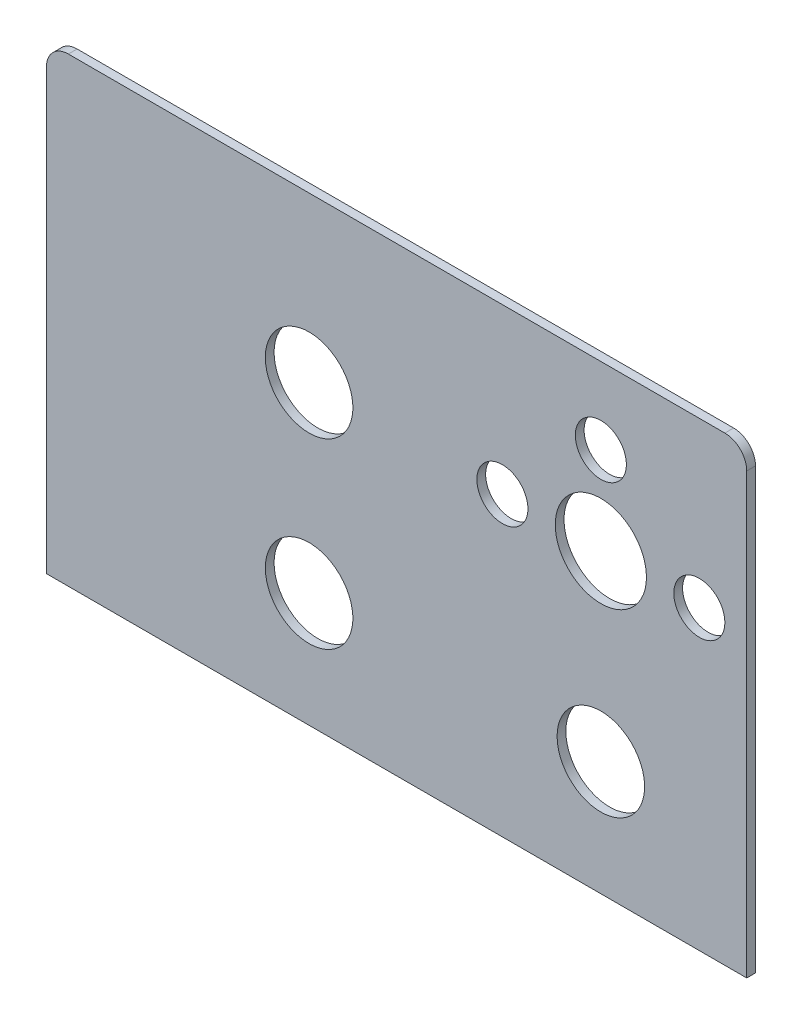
ISO-10303-21;
HEADER;
FILE_DESCRIPTION(('STEP AP214'),'2;1');
FILE_NAME('part.step','',(''),(''),'','','');
FILE_SCHEMA(('AUTOMOTIVE_DESIGN { 1 0 10303 214 1 1 1 1 }'));
ENDSEC;
DATA;
#1=APPLICATION_CONTEXT('core data for automotive mechanical design processes');
#2=APPLICATION_PROTOCOL_DEFINITION('international standard','automotive_design',2000,#1);
#3=PRODUCT_CONTEXT('',#1,'mechanical');
#4=PRODUCT('Part','Part','',(#3));
#5=PRODUCT_RELATED_PRODUCT_CATEGORY('part','',(#4));
#6=PRODUCT_DEFINITION_FORMATION('','',#4);
#7=PRODUCT_DEFINITION_CONTEXT('part definition',#1,'design');
#8=PRODUCT_DEFINITION('design','',#6,#7);
#9=PRODUCT_DEFINITION_SHAPE('','',#8);
#10=(LENGTH_UNIT() NAMED_UNIT(*) SI_UNIT(.MILLI.,.METRE.));
#11=(NAMED_UNIT(*) PLANE_ANGLE_UNIT() SI_UNIT($,.RADIAN.));
#12=(NAMED_UNIT(*) SI_UNIT($,.STERADIAN.) SOLID_ANGLE_UNIT());
#13=UNCERTAINTY_MEASURE_WITH_UNIT(LENGTH_MEASURE(1.E-05),#10,'distance_accuracy_value','');
#14=(GEOMETRIC_REPRESENTATION_CONTEXT(3) GLOBAL_UNCERTAINTY_ASSIGNED_CONTEXT((#13)) GLOBAL_UNIT_ASSIGNED_CONTEXT((#10,
#11,#12)) REPRESENTATION_CONTEXT('',''));
#15=CARTESIAN_POINT('',(0.,0.,0.));
#16=DIRECTION('',(0.,0.,1.));
#17=DIRECTION('',(1.,0.,0.));
#18=AXIS2_PLACEMENT_3D('',#15,#16,#17);
#19=CARTESIAN_POINT('',(0.,0.,-1.19999999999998));
#20=DIRECTION('',(1.,0.,0.));
#21=DIRECTION('',(0.,0.,-0.999999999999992));
#22=AXIS2_PLACEMENT_3D('',#19,#20,#21);
#23=PLANE('',#22);
#24=DIRECTION('',(0.,0.,0.999999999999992));
#25=VECTOR('',#24,1.);
#26=CARTESIAN_POINT('',(0.,1.80000000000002,-1.19999999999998));
#27=LINE('',#26,#25);
#28=CARTESIAN_POINT('',(0.,1.80000000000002,-1.19999999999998));
#29=VERTEX_POINT('',#28);
#30=CARTESIAN_POINT('',(0.,1.80000000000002,0.));
#31=VERTEX_POINT('',#30);
#32=EDGE_CURVE('E127',#29,#31,#27,.T.);
#33=ORIENTED_EDGE('',*,*,#32,.F.);
#34=DIRECTION('',(0.,1.00000000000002,0.));
#35=VECTOR('',#34,1.);
#36=CARTESIAN_POINT('',(0.,0.,-1.19999999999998));
#37=LINE('',#36,#35);
#38=CARTESIAN_POINT('',(2.91433543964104E-13,62.0000000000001,-1.20000000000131));
#39=VERTEX_POINT('',#38);
#40=EDGE_CURVE('E121',#29,#39,#37,.T.);
#41=ORIENTED_EDGE('',*,*,#40,.T.);
#42=DIRECTION('',(0.,0.,0.999999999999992));
#43=VECTOR('',#42,1.);
#44=CARTESIAN_POINT('',(2.91433543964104E-13,62.0000000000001,-1.20000000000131));
#45=LINE('',#44,#43);
#46=CARTESIAN_POINT('',(2.08166817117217E-13,62.0000000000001,-1.33226762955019E-12));
#47=VERTEX_POINT('',#46);
#48=EDGE_CURVE('E11',#39,#47,#45,.T.);
#49=ORIENTED_EDGE('',*,*,#48,.T.);
#50=DIRECTION('',(0.,1.00000000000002,0.));
#51=VECTOR('',#50,1.);
#52=CARTESIAN_POINT('',(0.,0.,0.));
#53=LINE('',#52,#51);
#54=EDGE_CURVE('E162',#31,#47,#53,.T.);
#55=ORIENTED_EDGE('',*,*,#54,.F.);
#56=EDGE_LOOP('',(#33,#41,#49,#55));
#57=FACE_BOUND('',#56,.T.);
#58=ADVANCED_FACE('F44',(#57),#23,.T.);
#59=CARTESIAN_POINT('',(0.,0.,-1.19999999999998));
#60=DIRECTION('',(0.,0.,0.999999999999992));
#61=DIRECTION('',(1.,0.,0.));
#62=AXIS2_PLACEMENT_3D('',#59,#60,#61);
#63=PLANE('',#62);
#64=CARTESIAN_POINT('',(-19.9999999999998,17.4999999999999,-1.19999999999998));
#65=DIRECTION('',(0.,0.,-0.999999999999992));
#66=DIRECTION('',(-1.,0.,0.));
#67=AXIS2_PLACEMENT_3D('',#64,#65,#66);
#68=CIRCLE('',#67,6.);
#69=CARTESIAN_POINT('',(-26.,17.4999999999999,-1.19999999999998));
#70=VERTEX_POINT('',#69);
#71=EDGE_CURVE('E204',#70,#70,#68,.T.);
#72=ORIENTED_EDGE('',*,*,#71,.F.);
#73=EDGE_LOOP('',(#72));
#74=FACE_BOUND('',#73,.T.);
#75=CARTESIAN_POINT('',(-60.,17.4999999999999,-1.19999999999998));
#76=DIRECTION('',(0.,0.,-0.999999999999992));
#77=DIRECTION('',(-1.,0.,0.));
#78=AXIS2_PLACEMENT_3D('',#75,#76,#77);
#79=CIRCLE('',#78,6.);
#80=CARTESIAN_POINT('',(-66.,17.4999999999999,-1.19999999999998));
#81=VERTEX_POINT('',#80);
#82=EDGE_CURVE('E433',#81,#81,#79,.T.);
#83=ORIENTED_EDGE('',*,*,#82,.F.);
#84=EDGE_LOOP('',(#83));
#85=FACE_BOUND('',#84,.T.);
#86=CARTESIAN_POINT('',(-60.,42.5,-1.20000000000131));
#87=DIRECTION('',(0.,0.,-0.999999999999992));
#88=DIRECTION('',(-1.,0.,0.));
#89=AXIS2_PLACEMENT_3D('',#86,#87,#88);
#90=CIRCLE('',#89,6.);
#91=CARTESIAN_POINT('',(-66.,42.4999999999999,-1.20000000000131));
#92=VERTEX_POINT('',#91);
#93=EDGE_CURVE('E436',#92,#92,#90,.T.);
#94=ORIENTED_EDGE('',*,*,#93,.F.);
#95=EDGE_LOOP('',(#94));
#96=FACE_BOUND('',#95,.T.);
#97=CARTESIAN_POINT('',(-19.9999999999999,42.5,-1.20000000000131));
#98=DIRECTION('',(0.,0.,0.999999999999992));
#99=DIRECTION('',(1.,0.,0.));
#100=AXIS2_PLACEMENT_3D('',#97,#98,#99);
#101=CIRCLE('',#100,6.25);
#102=CARTESIAN_POINT('',(-13.7499999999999,42.5,-1.20000000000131));
#103=VERTEX_POINT('',#102);
#104=EDGE_CURVE('E134',#103,#103,#101,.T.);
#105=ORIENTED_EDGE('',*,*,#104,.T.);
#106=EDGE_LOOP('',(#105));
#107=FACE_BOUND('',#106,.T.);
#108=CARTESIAN_POINT('',(-33.4999999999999,42.5,-1.20000000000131));
#109=DIRECTION('',(0.,0.,0.999999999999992));
#110=DIRECTION('',(1.,0.,0.));
#111=AXIS2_PLACEMENT_3D('',#108,#109,#110);
#112=CIRCLE('',#111,3.5);
#113=CARTESIAN_POINT('',(-29.9999999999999,42.5,-1.20000000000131));
#114=VERTEX_POINT('',#113);
#115=EDGE_CURVE('E158',#114,#114,#112,.T.);
#116=ORIENTED_EDGE('',*,*,#115,.T.);
#117=EDGE_LOOP('',(#116));
#118=FACE_BOUND('',#117,.T.);
#119=CARTESIAN_POINT('',(-6.49999999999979,42.5,-1.19999999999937));
#120=DIRECTION('',(0.,0.,0.999999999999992));
#121=DIRECTION('',(1.,0.,0.));
#122=AXIS2_PLACEMENT_3D('',#119,#120,#121);
#123=CIRCLE('',#122,3.50000000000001);
#124=CARTESIAN_POINT('',(-2.99999999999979,42.5,-1.19999999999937));
#125=VERTEX_POINT('',#124);
#126=EDGE_CURVE('E150',#125,#125,#123,.T.);
#127=ORIENTED_EDGE('',*,*,#126,.T.);
#128=EDGE_LOOP('',(#127));
#129=FACE_BOUND('',#128,.T.);
#130=CARTESIAN_POINT('',(-20.,54.5,-1.19999999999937));
#131=DIRECTION('',(0.,0.,0.999999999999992));
#132=DIRECTION('',(1.,0.,0.));
#133=AXIS2_PLACEMENT_3D('',#130,#131,#132);
#134=CIRCLE('',#133,3.5);
#135=CARTESIAN_POINT('',(-16.5,54.5,-1.19999999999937));
#136=VERTEX_POINT('',#135);
#137=EDGE_CURVE('E142',#136,#136,#134,.T.);
#138=ORIENTED_EDGE('',*,*,#137,.T.);
#139=EDGE_LOOP('',(#138));
#140=FACE_BOUND('',#139,.T.);
#141=ORIENTED_EDGE('',*,*,#40,.F.);
#142=DIRECTION('',(1.,0.,0.));
#143=VECTOR('',#142,1.);
#144=CARTESIAN_POINT('',(14.7999999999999,1.80000000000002,-1.19999999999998));
#145=LINE('',#144,#143);
#146=CARTESIAN_POINT('',(-96.,1.79999999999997,-1.19999999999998));
#147=VERTEX_POINT('',#146);
#148=EDGE_CURVE('E105',#147,#29,#145,.T.);
#149=ORIENTED_EDGE('',*,*,#148,.F.);
#150=DIRECTION('',(0.,-1.00000000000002,0.));
#151=VECTOR('',#150,1.);
#152=CARTESIAN_POINT('',(-96.,0.,-1.19999999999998));
#153=LINE('',#152,#151);
#154=CARTESIAN_POINT('',(-95.9999999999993,61.9999999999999,-1.19999999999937));
#155=VERTEX_POINT('',#154);
#156=EDGE_CURVE('E110',#155,#147,#153,.T.);
#157=ORIENTED_EDGE('',*,*,#156,.F.);
#158=CARTESIAN_POINT('',(-92.9999999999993,61.9999999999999,-1.20000000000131));
#159=DIRECTION('',(0.,0.,0.999999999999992));
#160=DIRECTION('',(1.,0.,0.));
#161=AXIS2_PLACEMENT_3D('',#158,#159,#160);
#162=CIRCLE('',#161,3.);
#163=CARTESIAN_POINT('',(-92.9999999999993,64.9999999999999,-1.20000000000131));
#164=VERTEX_POINT('',#163);
#165=EDGE_CURVE('E54',#155,#164,#162,.F.);
#166=ORIENTED_EDGE('',*,*,#165,.T.);
#167=DIRECTION('',(-1.,0.,0.));
#168=VECTOR('',#167,1.);
#169=CARTESIAN_POINT('',(2.4980018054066E-13,65.,-1.20000000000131));
#170=LINE('',#169,#168);
#171=CARTESIAN_POINT('',(-2.99999999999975,65.,-1.20000000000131));
#172=VERTEX_POINT('',#171);
#173=EDGE_CURVE('E117',#172,#164,#170,.T.);
#174=ORIENTED_EDGE('',*,*,#173,.F.);
#175=CARTESIAN_POINT('',(-2.99999999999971,62.0000000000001,-1.20000000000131));
#176=DIRECTION('',(0.,0.,0.999999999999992));
#177=DIRECTION('',(1.,0.,0.));
#178=AXIS2_PLACEMENT_3D('',#175,#176,#177);
#179=CIRCLE('',#178,3.);
#180=EDGE_CURVE('E70',#172,#39,#179,.F.);
#181=ORIENTED_EDGE('',*,*,#180,.T.);
#182=EDGE_LOOP('',(#141,#149,#157,#166,#174,#181));
#183=FACE_BOUND('',#182,.T.);
#184=ADVANCED_FACE('F119',(#74,#85,#96,#107,#118,#129,#140,#183),#63,.F.);
#185=CARTESIAN_POINT('',(0.,0.,0.));
#186=DIRECTION('',(0.,0.,0.999999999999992));
#187=DIRECTION('',(1.,0.,0.));
#188=AXIS2_PLACEMENT_3D('',#185,#186,#187);
#189=PLANE('',#188);
#190=CARTESIAN_POINT('',(-19.9999999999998,17.4999999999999,0.));
#191=DIRECTION('',(0.,0.,0.999999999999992));
#192=DIRECTION('',(1.,0.,0.));
#193=AXIS2_PLACEMENT_3D('',#190,#191,#192);
#194=CIRCLE('',#193,6.);
#195=CARTESIAN_POINT('',(-26.,17.4999999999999,0.));
#196=VERTEX_POINT('',#195);
#197=EDGE_CURVE('E48',#196,#196,#194,.T.);
#198=ORIENTED_EDGE('',*,*,#197,.F.);
#199=EDGE_LOOP('',(#198));
#200=FACE_BOUND('',#199,.T.);
#201=CARTESIAN_POINT('',(-60.0000000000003,17.4999999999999,0.));
#202=DIRECTION('',(0.,0.,0.999999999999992));
#203=DIRECTION('',(1.,0.,0.));
#204=AXIS2_PLACEMENT_3D('',#201,#202,#203);
#205=CIRCLE('',#204,6.);
#206=CARTESIAN_POINT('',(-66.,17.4999999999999,0.));
#207=VERTEX_POINT('',#206);
#208=EDGE_CURVE('E203',#207,#207,#205,.T.);
#209=ORIENTED_EDGE('',*,*,#208,.F.);
#210=EDGE_LOOP('',(#209));
#211=FACE_BOUND('',#210,.T.);
#212=CARTESIAN_POINT('',(-59.9999999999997,42.5,-1.33226762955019E-12));
#213=DIRECTION('',(0.,0.,0.999999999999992));
#214=DIRECTION('',(1.,0.,0.));
#215=AXIS2_PLACEMENT_3D('',#212,#213,#214);
#216=CIRCLE('',#215,6.);
#217=CARTESIAN_POINT('',(-66.,42.4999999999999,-1.33573707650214E-12));
#218=VERTEX_POINT('',#217);
#219=EDGE_CURVE('E200',#218,#218,#216,.T.);
#220=ORIENTED_EDGE('',*,*,#219,.F.);
#221=EDGE_LOOP('',(#220));
#222=FACE_BOUND('',#221,.T.);
#223=DIRECTION('',(-1.,0.,0.));
#224=VECTOR('',#223,1.);
#225=CARTESIAN_POINT('',(0.,1.80000000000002,0.));
#226=LINE('',#225,#224);
#227=CARTESIAN_POINT('',(-96.,1.79999999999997,0.));
#228=VERTEX_POINT('',#227);
#229=EDGE_CURVE('E106',#31,#228,#226,.T.);
#230=ORIENTED_EDGE('',*,*,#229,.F.);
#231=ORIENTED_EDGE('',*,*,#54,.T.);
#232=CARTESIAN_POINT('',(-2.99999999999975,62.0000000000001,-1.33226762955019E-12));
#233=DIRECTION('',(0.,0.,0.999999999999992));
#234=DIRECTION('',(1.,0.,0.));
#235=AXIS2_PLACEMENT_3D('',#232,#233,#234);
#236=CIRCLE('',#235,3.);
#237=CARTESIAN_POINT('',(-2.99999999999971,65.,-1.33226762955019E-12));
#238=VERTEX_POINT('',#237);
#239=EDGE_CURVE('E186',#47,#238,#236,.T.);
#240=ORIENTED_EDGE('',*,*,#239,.T.);
#241=DIRECTION('',(-1.,0.,0.));
#242=VECTOR('',#241,1.);
#243=CARTESIAN_POINT('',(2.91433543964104E-13,65.,-1.33226762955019E-12));
#244=LINE('',#243,#242);
#245=CARTESIAN_POINT('',(-92.9999999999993,64.9999999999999,-1.33226762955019E-12));
#246=VERTEX_POINT('',#245);
#247=EDGE_CURVE('E175',#238,#246,#244,.T.);
#248=ORIENTED_EDGE('',*,*,#247,.T.);
#249=CARTESIAN_POINT('',(-92.9999999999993,61.9999999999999,-1.33226762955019E-12));
#250=DIRECTION('',(0.,0.,0.999999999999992));
#251=DIRECTION('',(1.,0.,0.));
#252=AXIS2_PLACEMENT_3D('',#249,#250,#251);
#253=CIRCLE('',#252,3.);
#254=CARTESIAN_POINT('',(-95.9999999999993,61.9999999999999,6.66133814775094E-13));
#255=VERTEX_POINT('',#254);
#256=EDGE_CURVE('E190',#246,#255,#253,.T.);
#257=ORIENTED_EDGE('',*,*,#256,.T.);
#258=DIRECTION('',(0.,-1.00000000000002,0.));
#259=VECTOR('',#258,1.);
#260=CARTESIAN_POINT('',(-96.,0.,0.));
#261=LINE('',#260,#259);
#262=EDGE_CURVE('E168',#255,#228,#261,.T.);
#263=ORIENTED_EDGE('',*,*,#262,.T.);
#264=EDGE_LOOP('',(#230,#231,#240,#248,#257,#263));
#265=FACE_BOUND('',#264,.T.);
#266=CARTESIAN_POINT('',(-19.9999999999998,42.5,-1.33226762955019E-12));
#267=DIRECTION('',(0.,0.,0.999999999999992));
#268=DIRECTION('',(1.,0.,0.));
#269=AXIS2_PLACEMENT_3D('',#266,#267,#268);
#270=CIRCLE('',#269,6.25);
#271=CARTESIAN_POINT('',(-13.7499999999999,42.5,-1.32988238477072E-12));
#272=VERTEX_POINT('',#271);
#273=EDGE_CURVE('E133',#272,#272,#270,.T.);
#274=ORIENTED_EDGE('',*,*,#273,.F.);
#275=EDGE_LOOP('',(#274));
#276=FACE_BOUND('',#275,.T.);
#277=CARTESIAN_POINT('',(-19.9999999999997,54.5,6.66133814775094E-13));
#278=DIRECTION('',(0.,0.,0.999999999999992));
#279=DIRECTION('',(1.,0.,0.));
#280=AXIS2_PLACEMENT_3D('',#277,#278,#279);
#281=CIRCLE('',#280,3.5);
#282=CARTESIAN_POINT('',(-16.5,54.5,6.67434857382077E-13));
#283=VERTEX_POINT('',#282);
#284=EDGE_CURVE('E138',#283,#283,#281,.T.);
#285=ORIENTED_EDGE('',*,*,#284,.F.);
#286=EDGE_LOOP('',(#285));
#287=FACE_BOUND('',#286,.T.);
#288=CARTESIAN_POINT('',(-6.49999999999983,42.5,6.66133814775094E-13));
#289=DIRECTION('',(0.,0.,0.999999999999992));
#290=DIRECTION('',(1.,0.,0.));
#291=AXIS2_PLACEMENT_3D('',#288,#289,#290);
#292=CIRCLE('',#291,3.50000000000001);
#293=CARTESIAN_POINT('',(-2.99999999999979,42.5,6.67434857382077E-13));
#294=VERTEX_POINT('',#293);
#295=EDGE_CURVE('E146',#294,#294,#292,.T.);
#296=ORIENTED_EDGE('',*,*,#295,.F.);
#297=EDGE_LOOP('',(#296));
#298=FACE_BOUND('',#297,.T.);
#299=CARTESIAN_POINT('',(-33.4999999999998,42.5,-1.33226762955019E-12));
#300=DIRECTION('',(0.,0.,0.999999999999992));
#301=DIRECTION('',(1.,0.,0.));
#302=AXIS2_PLACEMENT_3D('',#299,#300,#301);
#303=CIRCLE('',#302,3.5);
#304=CARTESIAN_POINT('',(-29.9999999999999,42.5,-1.33096658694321E-12));
#305=VERTEX_POINT('',#304);
#306=EDGE_CURVE('E154',#305,#305,#303,.T.);
#307=ORIENTED_EDGE('',*,*,#306,.F.);
#308=EDGE_LOOP('',(#307));
#309=FACE_BOUND('',#308,.T.);
#310=ADVANCED_FACE('F218',(#200,#211,#222,#265,#276,#287,#298,#309),#189,.T.);
#311=CARTESIAN_POINT('',(-96.,0.,-1.19999999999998));
#312=DIRECTION('',(-1.,0.,0.));
#313=DIRECTION('',(0.,0.,0.999999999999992));
#314=AXIS2_PLACEMENT_3D('',#311,#312,#313);
#315=PLANE('',#314);
#316=DIRECTION('',(0.,0.,-0.999999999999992));
#317=VECTOR('',#316,1.);
#318=CARTESIAN_POINT('',(-96.0000000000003,1.79999999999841,70.6));
#319=LINE('',#318,#317);
#320=EDGE_CURVE('E62',#228,#147,#319,.T.);
#321=ORIENTED_EDGE('',*,*,#320,.F.);
#322=ORIENTED_EDGE('',*,*,#262,.F.);
#323=DIRECTION('',(0.,0.,0.999999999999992));
#324=VECTOR('',#323,1.);
#325=CARTESIAN_POINT('',(-95.9999999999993,61.9999999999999,-1.19999999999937));
#326=LINE('',#325,#324);
#327=EDGE_CURVE('E112',#255,#155,#326,.F.);
#328=ORIENTED_EDGE('',*,*,#327,.T.);
#329=ORIENTED_EDGE('',*,*,#156,.T.);
#330=EDGE_LOOP('',(#321,#322,#328,#329));
#331=FACE_BOUND('',#330,.T.);
#332=ADVANCED_FACE('F111',(#331),#315,.T.);
#333=CARTESIAN_POINT('',(2.4980018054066E-13,65.,-1.20000000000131));
#334=DIRECTION('',(0.,1.00000000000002,0.));
#335=DIRECTION('',(-1.,0.,0.));
#336=AXIS2_PLACEMENT_3D('',#333,#334,#335);
#337=PLANE('',#336);
#338=ORIENTED_EDGE('',*,*,#173,.T.);
#339=DIRECTION('',(0.,0.,0.999999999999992));
#340=VECTOR('',#339,1.);
#341=CARTESIAN_POINT('',(-92.9999999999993,64.9999999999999,-1.20000000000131));
#342=LINE('',#341,#340);
#343=EDGE_CURVE('E183',#164,#246,#342,.T.);
#344=ORIENTED_EDGE('',*,*,#343,.T.);
#345=ORIENTED_EDGE('',*,*,#247,.F.);
#346=DIRECTION('',(0.,0.,0.999999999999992));
#347=VECTOR('',#346,1.);
#348=CARTESIAN_POINT('',(-2.99999999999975,65.,-1.20000000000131));
#349=LINE('',#348,#347);
#350=EDGE_CURVE('E116',#238,#172,#349,.F.);
#351=ORIENTED_EDGE('',*,*,#350,.T.);
#352=EDGE_LOOP('',(#338,#344,#345,#351));
#353=FACE_BOUND('',#352,.T.);
#354=ADVANCED_FACE('F238',(#353),#337,.T.);
#355=CARTESIAN_POINT('',(-33.4999999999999,42.5,-1.20000000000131));
#356=DIRECTION('',(0.,0.,0.999999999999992));
#357=DIRECTION('',(1.,0.,0.));
#358=AXIS2_PLACEMENT_3D('',#355,#356,#357);
#359=CYLINDRICAL_SURFACE('',#358,3.5);
#360=CARTESIAN_POINT('',(-29.9999999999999,42.5,-1.20000000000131));
#361=CARTESIAN_POINT('',(-29.9999999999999,42.5,-1.18750000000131));
#362=CARTESIAN_POINT('',(-29.9999999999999,42.5,-1.17500000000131));
#363=CARTESIAN_POINT('',(-29.9999999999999,42.5,-1.15000000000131));
#364=CARTESIAN_POINT('',(-29.9999999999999,42.5,-1.13750000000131));
#365=CARTESIAN_POINT('',(-29.9999999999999,42.5,-1.11250000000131));
#366=CARTESIAN_POINT('',(-29.9999999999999,42.5,-1.10000000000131));
#367=CARTESIAN_POINT('',(-29.9999999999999,42.5,-1.07500000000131));
#368=CARTESIAN_POINT('',(-29.9999999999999,42.5,-1.06250000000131));
#369=CARTESIAN_POINT('',(-29.9999999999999,42.5,-1.03750000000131));
#370=CARTESIAN_POINT('',(-29.9999999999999,42.5,-1.02500000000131));
#371=CARTESIAN_POINT('',(-29.9999999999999,42.5,-1.00000000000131));
#372=CARTESIAN_POINT('',(-29.9999999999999,42.5,-0.987500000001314));
#373=CARTESIAN_POINT('',(-29.9999999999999,42.5,-0.962500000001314));
#374=CARTESIAN_POINT('',(-29.9999999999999,42.5,-0.950000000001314));
#375=CARTESIAN_POINT('',(-29.9999999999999,42.5,-0.925000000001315));
#376=CARTESIAN_POINT('',(-29.9999999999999,42.5,-0.912500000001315));
#377=CARTESIAN_POINT('',(-29.9999999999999,42.5,-0.887500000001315));
#378=CARTESIAN_POINT('',(-29.9999999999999,42.5,-0.875000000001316));
#379=CARTESIAN_POINT('',(-29.9999999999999,42.5,-0.850000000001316));
#380=CARTESIAN_POINT('',(-29.9999999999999,42.5,-0.837500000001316));
#381=CARTESIAN_POINT('',(-29.9999999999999,42.5,-0.812500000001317));
#382=CARTESIAN_POINT('',(-29.9999999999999,42.5,-0.800000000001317));
#383=CARTESIAN_POINT('',(-29.9999999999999,42.5,-0.775000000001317));
#384=CARTESIAN_POINT('',(-29.9999999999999,42.5,-0.762500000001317));
#385=CARTESIAN_POINT('',(-29.9999999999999,42.5,-0.737500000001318));
#386=CARTESIAN_POINT('',(-29.9999999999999,42.5,-0.725000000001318));
#387=CARTESIAN_POINT('',(-29.9999999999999,42.5,-0.700000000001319));
#388=CARTESIAN_POINT('',(-29.9999999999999,42.5,-0.687500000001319));
#389=CARTESIAN_POINT('',(-29.9999999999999,42.5,-0.662500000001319));
#390=CARTESIAN_POINT('',(-29.9999999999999,42.5,-0.650000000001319));
#391=CARTESIAN_POINT('',(-29.9999999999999,42.5,-0.62500000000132));
#392=CARTESIAN_POINT('',(-29.9999999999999,42.5,-0.61250000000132));
#393=CARTESIAN_POINT('',(-29.9999999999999,42.5,-0.587500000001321));
#394=CARTESIAN_POINT('',(-29.9999999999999,42.5,-0.575000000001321));
#395=CARTESIAN_POINT('',(-29.9999999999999,42.5,-0.550000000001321));
#396=CARTESIAN_POINT('',(-29.9999999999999,42.5,-0.537500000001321));
#397=CARTESIAN_POINT('',(-29.9999999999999,42.5,-0.512500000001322));
#398=CARTESIAN_POINT('',(-29.9999999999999,42.5,-0.500000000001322));
#399=CARTESIAN_POINT('',(-29.9999999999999,42.5,-0.475000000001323));
#400=CARTESIAN_POINT('',(-29.9999999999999,42.5,-0.462500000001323));
#401=CARTESIAN_POINT('',(-29.9999999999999,42.5,-0.437500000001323));
#402=CARTESIAN_POINT('',(-29.9999999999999,42.5,-0.425000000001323));
#403=CARTESIAN_POINT('',(-29.9999999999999,42.5,-0.400000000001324));
#404=CARTESIAN_POINT('',(-29.9999999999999,42.5,-0.387500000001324));
#405=CARTESIAN_POINT('',(-29.9999999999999,42.5,-0.362500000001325));
#406=CARTESIAN_POINT('',(-29.9999999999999,42.5,-0.350000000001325));
#407=CARTESIAN_POINT('',(-29.9999999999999,42.5,-0.325000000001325));
#408=CARTESIAN_POINT('',(-29.9999999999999,42.5,-0.312500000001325));
#409=CARTESIAN_POINT('',(-29.9999999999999,42.5,-0.287500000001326));
#410=CARTESIAN_POINT('',(-29.9999999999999,42.5,-0.275000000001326));
#411=CARTESIAN_POINT('',(-29.9999999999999,42.5,-0.250000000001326));
#412=CARTESIAN_POINT('',(-29.9999999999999,42.5,-0.237500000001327));
#413=CARTESIAN_POINT('',(-29.9999999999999,42.5,-0.212500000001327));
#414=CARTESIAN_POINT('',(-29.9999999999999,42.5,-0.200000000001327));
#415=CARTESIAN_POINT('',(-29.9999999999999,42.5,-0.175000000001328));
#416=CARTESIAN_POINT('',(-29.9999999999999,42.5,-0.162500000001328));
#417=CARTESIAN_POINT('',(-29.9999999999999,42.5,-0.137500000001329));
#418=CARTESIAN_POINT('',(-29.9999999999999,42.5,-0.125000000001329));
#419=CARTESIAN_POINT('',(-29.9999999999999,42.5,-0.100000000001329));
#420=CARTESIAN_POINT('',(-29.9999999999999,42.5,-0.0875000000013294));
#421=CARTESIAN_POINT('',(-29.9999999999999,42.5,-0.0625000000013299));
#422=CARTESIAN_POINT('',(-29.9999999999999,42.5,-0.0500000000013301));
#423=CARTESIAN_POINT('',(-29.9999999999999,42.5,-0.0250000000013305));
#424=CARTESIAN_POINT('',(-29.9999999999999,42.5,-0.0125000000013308));
#425=CARTESIAN_POINT('',(-29.9999999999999,42.5,-1.33096658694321E-12));
#426=B_SPLINE_CURVE_WITH_KNOTS('',3,(#360,#361,#362,#363,#364,#365,#366,#367,#368,#369,#370,
#371,#372,#373,#374,#375,#376,#377,#378,#379,#380,#381,#382,#383,#384,#385,#386,#387,#388,#389,
#390,#391,#392,#393,#394,#395,#396,#397,#398,#399,#400,#401,#402,#403,#404,#405,#406,#407,#408,
#409,#410,#411,#412,#413,#414,#415,#416,#417,#418,#419,#420,#421,#422,#423,#424,#425),
.UNSPECIFIED.,.F.,.F.,(4,2,2,2,2,2,2,2,2,2,2,2,2,2,2,2,2,2,2,2,2,2,2,2,2,2,2,2,2,2,2,2,4),(0.,
0.0374999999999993,0.0749999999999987,0.112499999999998,0.149999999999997,0.187499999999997,
0.224999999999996,0.262499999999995,0.299999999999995,0.337499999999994,0.374999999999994,
0.412499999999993,0.449999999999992,0.487499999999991,0.524999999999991,0.56249999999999,
0.59999999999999,0.637499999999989,0.674999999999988,0.712499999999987,0.749999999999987,
0.787499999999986,0.824999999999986,0.862499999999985,0.899999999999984,0.937499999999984,
0.974999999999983,1.01249999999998,1.04999999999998,1.08749999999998,1.12499999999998,
1.16249999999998,1.19999999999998),.UNSPECIFIED.);
#427=EDGE_CURVE('BSEAM235',#114,#305,#426,.T.);
#428=ORIENTED_EDGE('',*,*,#115,.F.);
#429=ORIENTED_EDGE('',*,*,#306,.T.);
#430=ORIENTED_EDGE('',*,*,#427,.T.);
#431=ORIENTED_EDGE('',*,*,#427,.F.);
#432=EDGE_LOOP('',(#428,#430,#429,#431));
#433=FACE_BOUND('',#432,.T.);
#434=ADVANCED_FACE('F235',(#433),#359,.F.);
#435=CARTESIAN_POINT('',(-6.49999999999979,42.5,-1.19999999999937));
#436=DIRECTION('',(0.,0.,0.999999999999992));
#437=DIRECTION('',(1.,0.,0.));
#438=AXIS2_PLACEMENT_3D('',#435,#436,#437);
#439=CYLINDRICAL_SURFACE('',#438,3.50000000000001);
#440=CARTESIAN_POINT('',(-2.99999999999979,42.5,-1.19999999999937));
#441=CARTESIAN_POINT('',(-2.99999999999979,42.5,-1.18749999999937));
#442=CARTESIAN_POINT('',(-2.99999999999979,42.5,-1.17499999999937));
#443=CARTESIAN_POINT('',(-2.99999999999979,42.5,-1.14999999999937));
#444=CARTESIAN_POINT('',(-2.99999999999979,42.5,-1.13749999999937));
#445=CARTESIAN_POINT('',(-2.99999999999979,42.5,-1.11249999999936));
#446=CARTESIAN_POINT('',(-2.99999999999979,42.5,-1.09999999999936));
#447=CARTESIAN_POINT('',(-2.99999999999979,42.5,-1.07499999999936));
#448=CARTESIAN_POINT('',(-2.99999999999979,42.5,-1.06249999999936));
#449=CARTESIAN_POINT('',(-2.99999999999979,42.5,-1.03749999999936));
#450=CARTESIAN_POINT('',(-2.99999999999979,42.5,-1.02499999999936));
#451=CARTESIAN_POINT('',(-2.99999999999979,42.5,-0.999999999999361));
#452=CARTESIAN_POINT('',(-2.99999999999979,42.5,-0.987499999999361));
#453=CARTESIAN_POINT('',(-2.99999999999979,42.5,-0.96249999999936));
#454=CARTESIAN_POINT('',(-2.99999999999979,42.5,-0.94999999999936));
#455=CARTESIAN_POINT('',(-2.99999999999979,42.5,-0.924999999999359));
#456=CARTESIAN_POINT('',(-2.99999999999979,42.5,-0.912499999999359));
#457=CARTESIAN_POINT('',(-2.99999999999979,42.5,-0.887499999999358));
#458=CARTESIAN_POINT('',(-2.99999999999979,42.5,-0.874999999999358));
#459=CARTESIAN_POINT('',(-2.99999999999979,42.5,-0.849999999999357));
#460=CARTESIAN_POINT('',(-2.99999999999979,42.5,-0.837499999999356));
#461=CARTESIAN_POINT('',(-2.99999999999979,42.5,-0.812499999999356));
#462=CARTESIAN_POINT('',(-2.99999999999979,42.5,-0.799999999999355));
#463=CARTESIAN_POINT('',(-2.99999999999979,42.5,-0.774999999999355));
#464=CARTESIAN_POINT('',(-2.99999999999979,42.5,-0.762499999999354));
#465=CARTESIAN_POINT('',(-2.99999999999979,42.5,-0.737499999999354));
#466=CARTESIAN_POINT('',(-2.99999999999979,42.5,-0.724999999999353));
#467=CARTESIAN_POINT('',(-2.99999999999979,42.5,-0.699999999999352));
#468=CARTESIAN_POINT('',(-2.99999999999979,42.5,-0.687499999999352));
#469=CARTESIAN_POINT('',(-2.99999999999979,42.5,-0.662499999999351));
#470=CARTESIAN_POINT('',(-2.99999999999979,42.5,-0.649999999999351));
#471=CARTESIAN_POINT('',(-2.99999999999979,42.5,-0.62499999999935));
#472=CARTESIAN_POINT('',(-2.99999999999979,42.5,-0.61249999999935));
#473=CARTESIAN_POINT('',(-2.99999999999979,42.5,-0.587499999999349));
#474=CARTESIAN_POINT('',(-2.99999999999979,42.5,-0.574999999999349));
#475=CARTESIAN_POINT('',(-2.99999999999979,42.5,-0.549999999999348));
#476=CARTESIAN_POINT('',(-2.99999999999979,42.5,-0.537499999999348));
#477=CARTESIAN_POINT('',(-2.99999999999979,42.5,-0.512499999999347));
#478=CARTESIAN_POINT('',(-2.99999999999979,42.5,-0.499999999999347));
#479=CARTESIAN_POINT('',(-2.99999999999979,42.5,-0.474999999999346));
#480=CARTESIAN_POINT('',(-2.99999999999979,42.5,-0.462499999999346));
#481=CARTESIAN_POINT('',(-2.99999999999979,42.5,-0.437499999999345));
#482=CARTESIAN_POINT('',(-2.99999999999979,42.5,-0.424999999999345));
#483=CARTESIAN_POINT('',(-2.99999999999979,42.5,-0.399999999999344));
#484=CARTESIAN_POINT('',(-2.99999999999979,42.5,-0.387499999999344));
#485=CARTESIAN_POINT('',(-2.99999999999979,42.5,-0.362499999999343));
#486=CARTESIAN_POINT('',(-2.99999999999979,42.5,-0.349999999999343));
#487=CARTESIAN_POINT('',(-2.99999999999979,42.5,-0.324999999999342));
#488=CARTESIAN_POINT('',(-2.99999999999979,42.5,-0.312499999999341));
#489=CARTESIAN_POINT('',(-2.99999999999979,42.5,-0.287499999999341));
#490=CARTESIAN_POINT('',(-2.99999999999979,42.5,-0.27499999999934));
#491=CARTESIAN_POINT('',(-2.99999999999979,42.5,-0.24999999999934));
#492=CARTESIAN_POINT('',(-2.99999999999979,42.5,-0.237499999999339));
#493=CARTESIAN_POINT('',(-2.99999999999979,42.5,-0.212499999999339));
#494=CARTESIAN_POINT('',(-2.99999999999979,42.5,-0.199999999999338));
#495=CARTESIAN_POINT('',(-2.99999999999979,42.5,-0.174999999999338));
#496=CARTESIAN_POINT('',(-2.99999999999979,42.5,-0.162499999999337));
#497=CARTESIAN_POINT('',(-2.99999999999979,42.5,-0.137499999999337));
#498=CARTESIAN_POINT('',(-2.99999999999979,42.5,-0.124999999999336));
#499=CARTESIAN_POINT('',(-2.99999999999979,42.5,-0.0999999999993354));
#500=CARTESIAN_POINT('',(-2.99999999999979,42.5,-0.0874999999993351));
#501=CARTESIAN_POINT('',(-2.99999999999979,42.5,-0.0624999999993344));
#502=CARTESIAN_POINT('',(-2.99999999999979,42.5,-0.049999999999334));
#503=CARTESIAN_POINT('',(-2.99999999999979,42.5,-0.0249999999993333));
#504=CARTESIAN_POINT('',(-2.99999999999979,42.5,-0.0124999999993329));
#505=CARTESIAN_POINT('',(-2.99999999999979,42.5,6.67434857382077E-13));
#506=B_SPLINE_CURVE_WITH_KNOTS('',3,(#440,#441,#442,#443,#444,#445,#446,#447,#448,#449,#450,
#451,#452,#453,#454,#455,#456,#457,#458,#459,#460,#461,#462,#463,#464,#465,#466,#467,#468,#469,
#470,#471,#472,#473,#474,#475,#476,#477,#478,#479,#480,#481,#482,#483,#484,#485,#486,#487,#488,
#489,#490,#491,#492,#493,#494,#495,#496,#497,#498,#499,#500,#501,#502,#503,#504,#505),
.UNSPECIFIED.,.F.,.F.,(4,2,2,2,2,2,2,2,2,2,2,2,2,2,2,2,2,2,2,2,2,2,2,2,2,2,2,2,2,2,2,2,4),(0.,
0.0375000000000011,0.0750000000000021,0.112500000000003,0.150000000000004,0.187500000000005,
0.225000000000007,0.262500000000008,0.300000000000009,0.33750000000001,0.375000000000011,
0.412500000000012,0.450000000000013,0.487500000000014,0.525000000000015,0.562500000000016,
0.600000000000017,0.637500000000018,0.675000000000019,0.71250000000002,0.750000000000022,
0.787500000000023,0.825000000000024,0.862500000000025,0.900000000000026,0.937500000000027,
0.975000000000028,1.01250000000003,1.05000000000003,1.08750000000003,1.12500000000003,
1.16250000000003,1.20000000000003),.UNSPECIFIED.);
#507=EDGE_CURVE('BSEAM237',#125,#294,#506,.T.);
#508=ORIENTED_EDGE('',*,*,#126,.F.);
#509=ORIENTED_EDGE('',*,*,#295,.T.);
#510=ORIENTED_EDGE('',*,*,#507,.T.);
#511=ORIENTED_EDGE('',*,*,#507,.F.);
#512=EDGE_LOOP('',(#508,#510,#509,#511));
#513=FACE_BOUND('',#512,.T.);
#514=ADVANCED_FACE('F237',(#513),#439,.F.);
#515=CARTESIAN_POINT('',(-20.,54.5,-1.19999999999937));
#516=DIRECTION('',(0.,0.,0.999999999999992));
#517=DIRECTION('',(1.,0.,0.));
#518=AXIS2_PLACEMENT_3D('',#515,#516,#517);
#519=CYLINDRICAL_SURFACE('',#518,3.5);
#520=CARTESIAN_POINT('',(-16.5,54.5,-1.19999999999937));
#521=CARTESIAN_POINT('',(-16.5,54.5,-1.18749999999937));
#522=CARTESIAN_POINT('',(-16.5,54.5,-1.17499999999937));
#523=CARTESIAN_POINT('',(-16.5,54.5,-1.14999999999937));
#524=CARTESIAN_POINT('',(-16.5,54.5,-1.13749999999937));
#525=CARTESIAN_POINT('',(-16.5,54.5,-1.11249999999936));
#526=CARTESIAN_POINT('',(-16.5,54.5,-1.09999999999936));
#527=CARTESIAN_POINT('',(-16.5,54.5,-1.07499999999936));
#528=CARTESIAN_POINT('',(-16.5,54.5,-1.06249999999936));
#529=CARTESIAN_POINT('',(-16.5,54.5,-1.03749999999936));
#530=CARTESIAN_POINT('',(-16.5,54.5,-1.02499999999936));
#531=CARTESIAN_POINT('',(-16.5,54.5,-0.999999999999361));
#532=CARTESIAN_POINT('',(-16.5,54.5,-0.987499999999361));
#533=CARTESIAN_POINT('',(-16.5,54.5,-0.96249999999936));
#534=CARTESIAN_POINT('',(-16.5,54.5,-0.94999999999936));
#535=CARTESIAN_POINT('',(-16.5,54.5,-0.924999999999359));
#536=CARTESIAN_POINT('',(-16.5,54.5,-0.912499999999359));
#537=CARTESIAN_POINT('',(-16.5,54.5,-0.887499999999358));
#538=CARTESIAN_POINT('',(-16.5,54.5,-0.874999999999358));
#539=CARTESIAN_POINT('',(-16.5,54.5,-0.849999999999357));
#540=CARTESIAN_POINT('',(-16.5,54.5,-0.837499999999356));
#541=CARTESIAN_POINT('',(-16.5,54.5,-0.812499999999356));
#542=CARTESIAN_POINT('',(-16.5,54.5,-0.799999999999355));
#543=CARTESIAN_POINT('',(-16.5,54.5,-0.774999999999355));
#544=CARTESIAN_POINT('',(-16.5,54.5,-0.762499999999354));
#545=CARTESIAN_POINT('',(-16.5,54.5,-0.737499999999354));
#546=CARTESIAN_POINT('',(-16.5,54.5,-0.724999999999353));
#547=CARTESIAN_POINT('',(-16.5,54.5,-0.699999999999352));
#548=CARTESIAN_POINT('',(-16.5,54.5,-0.687499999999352));
#549=CARTESIAN_POINT('',(-16.5,54.5,-0.662499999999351));
#550=CARTESIAN_POINT('',(-16.5,54.5,-0.649999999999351));
#551=CARTESIAN_POINT('',(-16.5,54.5,-0.62499999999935));
#552=CARTESIAN_POINT('',(-16.5,54.5,-0.61249999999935));
#553=CARTESIAN_POINT('',(-16.5,54.5,-0.587499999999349));
#554=CARTESIAN_POINT('',(-16.5,54.5,-0.574999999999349));
#555=CARTESIAN_POINT('',(-16.5,54.5,-0.549999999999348));
#556=CARTESIAN_POINT('',(-16.5,54.5,-0.537499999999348));
#557=CARTESIAN_POINT('',(-16.5,54.5,-0.512499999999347));
#558=CARTESIAN_POINT('',(-16.5,54.5,-0.499999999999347));
#559=CARTESIAN_POINT('',(-16.5,54.5,-0.474999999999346));
#560=CARTESIAN_POINT('',(-16.5,54.5,-0.462499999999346));
#561=CARTESIAN_POINT('',(-16.5,54.5,-0.437499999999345));
#562=CARTESIAN_POINT('',(-16.5,54.5,-0.424999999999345));
#563=CARTESIAN_POINT('',(-16.5,54.5,-0.399999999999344));
#564=CARTESIAN_POINT('',(-16.5,54.5,-0.387499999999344));
#565=CARTESIAN_POINT('',(-16.5,54.5,-0.362499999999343));
#566=CARTESIAN_POINT('',(-16.5,54.5,-0.349999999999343));
#567=CARTESIAN_POINT('',(-16.5,54.5,-0.324999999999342));
#568=CARTESIAN_POINT('',(-16.5,54.5,-0.312499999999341));
#569=CARTESIAN_POINT('',(-16.5,54.5,-0.287499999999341));
#570=CARTESIAN_POINT('',(-16.5,54.5,-0.27499999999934));
#571=CARTESIAN_POINT('',(-16.5,54.5,-0.24999999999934));
#572=CARTESIAN_POINT('',(-16.5,54.5,-0.237499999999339));
#573=CARTESIAN_POINT('',(-16.5,54.5,-0.212499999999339));
#574=CARTESIAN_POINT('',(-16.5,54.5,-0.199999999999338));
#575=CARTESIAN_POINT('',(-16.5,54.5,-0.174999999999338));
#576=CARTESIAN_POINT('',(-16.5,54.5,-0.162499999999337));
#577=CARTESIAN_POINT('',(-16.5,54.5,-0.137499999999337));
#578=CARTESIAN_POINT('',(-16.5,54.5,-0.124999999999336));
#579=CARTESIAN_POINT('',(-16.5,54.5,-0.0999999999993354));
#580=CARTESIAN_POINT('',(-16.5,54.5,-0.0874999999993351));
#581=CARTESIAN_POINT('',(-16.5,54.5,-0.0624999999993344));
#582=CARTESIAN_POINT('',(-16.5,54.5,-0.049999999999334));
#583=CARTESIAN_POINT('',(-16.5,54.5,-0.0249999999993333));
#584=CARTESIAN_POINT('',(-16.5,54.5,-0.0124999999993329));
#585=CARTESIAN_POINT('',(-16.5,54.5,6.67434857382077E-13));
#586=B_SPLINE_CURVE_WITH_KNOTS('',3,(#520,#521,#522,#523,#524,#525,#526,#527,#528,#529,#530,
#531,#532,#533,#534,#535,#536,#537,#538,#539,#540,#541,#542,#543,#544,#545,#546,#547,#548,#549,
#550,#551,#552,#553,#554,#555,#556,#557,#558,#559,#560,#561,#562,#563,#564,#565,#566,#567,#568,
#569,#570,#571,#572,#573,#574,#575,#576,#577,#578,#579,#580,#581,#582,#583,#584,#585),
.UNSPECIFIED.,.F.,.F.,(4,2,2,2,2,2,2,2,2,2,2,2,2,2,2,2,2,2,2,2,2,2,2,2,2,2,2,2,2,2,2,2,4),(0.,
0.0375000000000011,0.0750000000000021,0.112500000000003,0.150000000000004,0.187500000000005,
0.225000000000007,0.262500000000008,0.300000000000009,0.33750000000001,0.375000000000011,
0.412500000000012,0.450000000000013,0.487500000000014,0.525000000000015,0.562500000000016,
0.600000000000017,0.637500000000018,0.675000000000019,0.71250000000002,0.750000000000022,
0.787500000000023,0.825000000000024,0.862500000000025,0.900000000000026,0.937500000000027,
0.975000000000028,1.01250000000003,1.05000000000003,1.08750000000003,1.12500000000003,
1.16250000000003,1.20000000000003),.UNSPECIFIED.);
#587=EDGE_CURVE('BSEAM245',#136,#283,#586,.T.);
#588=ORIENTED_EDGE('',*,*,#137,.F.);
#589=ORIENTED_EDGE('',*,*,#284,.T.);
#590=ORIENTED_EDGE('',*,*,#587,.T.);
#591=ORIENTED_EDGE('',*,*,#587,.F.);
#592=EDGE_LOOP('',(#588,#590,#589,#591));
#593=FACE_BOUND('',#592,.T.);
#594=ADVANCED_FACE('F245',(#593),#519,.F.);
#595=CARTESIAN_POINT('',(-19.9999999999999,42.5,-1.20000000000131));
#596=DIRECTION('',(0.,0.,0.999999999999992));
#597=DIRECTION('',(1.,0.,0.));
#598=AXIS2_PLACEMENT_3D('',#595,#596,#597);
#599=CYLINDRICAL_SURFACE('',#598,6.25);
#600=CARTESIAN_POINT('',(-13.7499999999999,42.5,-1.20000000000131));
#601=CARTESIAN_POINT('',(-13.7499999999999,42.5,-1.18750000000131));
#602=CARTESIAN_POINT('',(-13.7499999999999,42.5,-1.17500000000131));
#603=CARTESIAN_POINT('',(-13.7499999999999,42.5,-1.15000000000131));
#604=CARTESIAN_POINT('',(-13.7499999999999,42.5,-1.13750000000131));
#605=CARTESIAN_POINT('',(-13.7499999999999,42.5,-1.11250000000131));
#606=CARTESIAN_POINT('',(-13.7499999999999,42.5,-1.10000000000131));
#607=CARTESIAN_POINT('',(-13.7499999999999,42.5,-1.07500000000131));
#608=CARTESIAN_POINT('',(-13.7499999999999,42.5,-1.06250000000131));
#609=CARTESIAN_POINT('',(-13.7499999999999,42.5,-1.03750000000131));
#610=CARTESIAN_POINT('',(-13.7499999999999,42.5,-1.02500000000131));
#611=CARTESIAN_POINT('',(-13.7499999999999,42.5,-1.00000000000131));
#612=CARTESIAN_POINT('',(-13.7499999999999,42.5,-0.987500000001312));
#613=CARTESIAN_POINT('',(-13.7499999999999,42.5,-0.962500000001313));
#614=CARTESIAN_POINT('',(-13.7499999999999,42.5,-0.950000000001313));
#615=CARTESIAN_POINT('',(-13.7499999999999,42.5,-0.925000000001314));
#616=CARTESIAN_POINT('',(-13.7499999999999,42.5,-0.912500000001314));
#617=CARTESIAN_POINT('',(-13.7499999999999,42.5,-0.887500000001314));
#618=CARTESIAN_POINT('',(-13.7499999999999,42.5,-0.875000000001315));
#619=CARTESIAN_POINT('',(-13.7499999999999,42.5,-0.850000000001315));
#620=CARTESIAN_POINT('',(-13.7499999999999,42.5,-0.837500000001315));
#621=CARTESIAN_POINT('',(-13.7499999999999,42.5,-0.812500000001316));
#622=CARTESIAN_POINT('',(-13.7499999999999,42.5,-0.800000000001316));
#623=CARTESIAN_POINT('',(-13.7499999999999,42.5,-0.775000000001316));
#624=CARTESIAN_POINT('',(-13.7499999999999,42.5,-0.762500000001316));
#625=CARTESIAN_POINT('',(-13.7499999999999,42.5,-0.737500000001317));
#626=CARTESIAN_POINT('',(-13.7499999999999,42.5,-0.725000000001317));
#627=CARTESIAN_POINT('',(-13.7499999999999,42.5,-0.700000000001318));
#628=CARTESIAN_POINT('',(-13.7499999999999,42.5,-0.687500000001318));
#629=CARTESIAN_POINT('',(-13.7499999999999,42.5,-0.662500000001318));
#630=CARTESIAN_POINT('',(-13.7499999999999,42.5,-0.650000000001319));
#631=CARTESIAN_POINT('',(-13.7499999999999,42.5,-0.625000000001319));
#632=CARTESIAN_POINT('',(-13.7499999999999,42.5,-0.612500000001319));
#633=CARTESIAN_POINT('',(-13.7499999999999,42.5,-0.58750000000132));
#634=CARTESIAN_POINT('',(-13.7499999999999,42.5,-0.57500000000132));
#635=CARTESIAN_POINT('',(-13.7499999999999,42.5,-0.55000000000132));
#636=CARTESIAN_POINT('',(-13.7499999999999,42.5,-0.53750000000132));
#637=CARTESIAN_POINT('',(-13.7499999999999,42.5,-0.512500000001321));
#638=CARTESIAN_POINT('',(-13.7499999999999,42.5,-0.500000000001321));
#639=CARTESIAN_POINT('',(-13.7499999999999,42.5,-0.475000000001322));
#640=CARTESIAN_POINT('',(-13.7499999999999,42.5,-0.462500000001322));
#641=CARTESIAN_POINT('',(-13.7499999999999,42.5,-0.437500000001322));
#642=CARTESIAN_POINT('',(-13.7499999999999,42.5,-0.425000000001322));
#643=CARTESIAN_POINT('',(-13.7499999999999,42.5,-0.400000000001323));
#644=CARTESIAN_POINT('',(-13.7499999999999,42.5,-0.387500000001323));
#645=CARTESIAN_POINT('',(-13.7499999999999,42.5,-0.362500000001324));
#646=CARTESIAN_POINT('',(-13.7499999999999,42.5,-0.350000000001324));
#647=CARTESIAN_POINT('',(-13.7499999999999,42.5,-0.325000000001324));
#648=CARTESIAN_POINT('',(-13.7499999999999,42.5,-0.312500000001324));
#649=CARTESIAN_POINT('',(-13.7499999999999,42.5,-0.287500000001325));
#650=CARTESIAN_POINT('',(-13.7499999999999,42.5,-0.275000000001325));
#651=CARTESIAN_POINT('',(-13.7499999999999,42.5,-0.250000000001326));
#652=CARTESIAN_POINT('',(-13.7499999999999,42.5,-0.237500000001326));
#653=CARTESIAN_POINT('',(-13.7499999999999,42.5,-0.212500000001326));
#654=CARTESIAN_POINT('',(-13.7499999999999,42.5,-0.200000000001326));
#655=CARTESIAN_POINT('',(-13.7499999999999,42.5,-0.175000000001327));
#656=CARTESIAN_POINT('',(-13.7499999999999,42.5,-0.162500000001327));
#657=CARTESIAN_POINT('',(-13.7499999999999,42.5,-0.137500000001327));
#658=CARTESIAN_POINT('',(-13.7499999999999,42.5,-0.125000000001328));
#659=CARTESIAN_POINT('',(-13.7499999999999,42.5,-0.100000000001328));
#660=CARTESIAN_POINT('',(-13.7499999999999,42.5,-0.0875000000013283));
#661=CARTESIAN_POINT('',(-13.7499999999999,42.5,-0.0625000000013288));
#662=CARTESIAN_POINT('',(-13.7499999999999,42.5,-0.050000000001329));
#663=CARTESIAN_POINT('',(-13.7499999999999,42.5,-0.0250000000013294));
#664=CARTESIAN_POINT('',(-13.7499999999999,42.5,-0.0125000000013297));
#665=CARTESIAN_POINT('',(-13.7499999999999,42.5,-1.32988238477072E-12));
#666=B_SPLINE_CURVE_WITH_KNOTS('',3,(#600,#601,#602,#603,#604,#605,#606,#607,#608,#609,#610,
#611,#612,#613,#614,#615,#616,#617,#618,#619,#620,#621,#622,#623,#624,#625,#626,#627,#628,#629,
#630,#631,#632,#633,#634,#635,#636,#637,#638,#639,#640,#641,#642,#643,#644,#645,#646,#647,#648,
#649,#650,#651,#652,#653,#654,#655,#656,#657,#658,#659,#660,#661,#662,#663,#664,#665),
.UNSPECIFIED.,.F.,.F.,(4,2,2,2,2,2,2,2,2,2,2,2,2,2,2,2,2,2,2,2,2,2,2,2,2,2,2,2,2,2,2,2,4),(0.,
0.0374999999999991,0.0749999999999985,0.112499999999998,0.149999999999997,0.187499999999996,
0.224999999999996,0.262499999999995,0.299999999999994,0.337499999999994,0.374999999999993,
0.412499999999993,0.449999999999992,0.487499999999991,0.524999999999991,0.56249999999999,
0.599999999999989,0.637499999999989,0.674999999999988,0.712499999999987,0.749999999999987,
0.787499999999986,0.824999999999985,0.862499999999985,0.899999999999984,0.937499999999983,
0.974999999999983,1.01249999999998,1.04999999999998,1.08749999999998,1.12499999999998,
1.16249999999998,1.19999999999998),.UNSPECIFIED.);
#667=EDGE_CURVE('BSEAM262',#103,#272,#666,.T.);
#668=ORIENTED_EDGE('',*,*,#104,.F.);
#669=ORIENTED_EDGE('',*,*,#273,.T.);
#670=ORIENTED_EDGE('',*,*,#667,.T.);
#671=ORIENTED_EDGE('',*,*,#667,.F.);
#672=EDGE_LOOP('',(#668,#670,#669,#671));
#673=FACE_BOUND('',#672,.T.);
#674=ADVANCED_FACE('F262',(#673),#599,.F.);
#675=CARTESIAN_POINT('',(-92.9999999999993,61.9999999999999,-1.20000000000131));
#676=DIRECTION('',(0.,0.,0.999999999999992));
#677=DIRECTION('',(1.,0.,0.));
#678=AXIS2_PLACEMENT_3D('',#675,#676,#677);
#679=CYLINDRICAL_SURFACE('',#678,3.);
#680=ORIENTED_EDGE('',*,*,#165,.F.);
#681=ORIENTED_EDGE('',*,*,#327,.F.);
#682=ORIENTED_EDGE('',*,*,#256,.F.);
#683=ORIENTED_EDGE('',*,*,#343,.F.);
#684=EDGE_LOOP('',(#680,#681,#682,#683));
#685=FACE_BOUND('',#684,.T.);
#686=ADVANCED_FACE('F260',(#685),#679,.T.);
#687=CARTESIAN_POINT('',(-2.99999999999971,62.0000000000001,-1.20000000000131));
#688=DIRECTION('',(0.,0.,0.999999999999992));
#689=DIRECTION('',(1.,0.,0.));
#690=AXIS2_PLACEMENT_3D('',#687,#688,#689);
#691=CYLINDRICAL_SURFACE('',#690,3.);
#692=ORIENTED_EDGE('',*,*,#180,.F.);
#693=ORIENTED_EDGE('',*,*,#350,.F.);
#694=ORIENTED_EDGE('',*,*,#239,.F.);
#695=ORIENTED_EDGE('',*,*,#48,.F.);
#696=EDGE_LOOP('',(#692,#693,#694,#695));
#697=FACE_BOUND('',#696,.T.);
#698=ADVANCED_FACE('F46',(#697),#691,.T.);
#699=CARTESIAN_POINT('',(0.,1.80000000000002,0.));
#700=DIRECTION('',(0.,1.00000000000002,0.));
#701=DIRECTION('',(0.,0.,0.999999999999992));
#702=AXIS2_PLACEMENT_3D('',#699,#700,#701);
#703=PLANE('',#702);
#704=ORIENTED_EDGE('',*,*,#32,.T.);
#705=ORIENTED_EDGE('',*,*,#229,.T.);
#706=ORIENTED_EDGE('',*,*,#320,.T.);
#707=ORIENTED_EDGE('',*,*,#148,.T.);
#708=EDGE_LOOP('',(#704,#705,#706,#707));
#709=FACE_BOUND('',#708,.T.);
#710=ADVANCED_FACE('F103',(#709),#703,.F.);
#711=CARTESIAN_POINT('',(-60.,42.5,8.7999999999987));
#712=DIRECTION('',(0.,0.,-0.999999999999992));
#713=DIRECTION('',(-1.,0.,0.));
#714=AXIS2_PLACEMENT_3D('',#711,#712,#713);
#715=CYLINDRICAL_SURFACE('',#714,6.);
#716=CARTESIAN_POINT('',(-66.,42.4999999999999,-1.33573707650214E-12));
#717=CARTESIAN_POINT('',(-66.,42.4999999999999,-0.0125000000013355));
#718=CARTESIAN_POINT('',(-66.,42.4999999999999,-0.0250000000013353));
#719=CARTESIAN_POINT('',(-66.,42.4999999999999,-0.0500000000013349));
#720=CARTESIAN_POINT('',(-66.,42.4999999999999,-0.0625000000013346));
#721=CARTESIAN_POINT('',(-66.,42.4999999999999,-0.0875000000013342));
#722=CARTESIAN_POINT('',(-66.,42.4999999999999,-0.100000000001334));
#723=CARTESIAN_POINT('',(-66.,42.4999999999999,-0.125000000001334));
#724=CARTESIAN_POINT('',(-66.,42.4999999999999,-0.137500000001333));
#725=CARTESIAN_POINT('',(-66.,42.4999999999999,-0.162500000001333));
#726=CARTESIAN_POINT('',(-66.,42.4999999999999,-0.175000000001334));
#727=CARTESIAN_POINT('',(-66.,42.4999999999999,-0.200000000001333));
#728=CARTESIAN_POINT('',(-66.,42.4999999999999,-0.212500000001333));
#729=CARTESIAN_POINT('',(-66.,42.4999999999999,-0.237500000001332));
#730=CARTESIAN_POINT('',(-66.,42.4999999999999,-0.250000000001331));
#731=CARTESIAN_POINT('',(-66.,42.4999999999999,-0.275000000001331));
#732=CARTESIAN_POINT('',(-66.,42.4999999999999,-0.287500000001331));
#733=CARTESIAN_POINT('',(-66.,42.4999999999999,-0.31250000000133));
#734=CARTESIAN_POINT('',(-66.,42.4999999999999,-0.32500000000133));
#735=CARTESIAN_POINT('',(-66.,42.4999999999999,-0.35000000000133));
#736=CARTESIAN_POINT('',(-66.,42.4999999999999,-0.362500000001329));
#737=CARTESIAN_POINT('',(-66.,42.4999999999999,-0.387500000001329));
#738=CARTESIAN_POINT('',(-66.,42.4999999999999,-0.400000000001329));
#739=CARTESIAN_POINT('',(-66.,42.4999999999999,-0.425000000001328));
#740=CARTESIAN_POINT('',(-66.,42.4999999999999,-0.437500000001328));
#741=CARTESIAN_POINT('',(-66.,42.4999999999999,-0.462500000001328));
#742=CARTESIAN_POINT('',(-66.,42.4999999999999,-0.475000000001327));
#743=CARTESIAN_POINT('',(-66.,42.4999999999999,-0.500000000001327));
#744=CARTESIAN_POINT('',(-66.,42.4999999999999,-0.512500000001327));
#745=CARTESIAN_POINT('',(-66.,42.4999999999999,-0.537500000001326));
#746=CARTESIAN_POINT('',(-66.,42.4999999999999,-0.550000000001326));
#747=CARTESIAN_POINT('',(-66.,42.4999999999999,-0.575000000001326));
#748=CARTESIAN_POINT('',(-66.,42.4999999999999,-0.587500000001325));
#749=CARTESIAN_POINT('',(-66.,42.4999999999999,-0.612500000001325));
#750=CARTESIAN_POINT('',(-66.,42.4999999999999,-0.625000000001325));
#751=CARTESIAN_POINT('',(-66.,42.4999999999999,-0.650000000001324));
#752=CARTESIAN_POINT('',(-66.,42.4999999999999,-0.662500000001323));
#753=CARTESIAN_POINT('',(-66.,42.4999999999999,-0.687500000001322));
#754=CARTESIAN_POINT('',(-66.,42.4999999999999,-0.700000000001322));
#755=CARTESIAN_POINT('',(-66.,42.4999999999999,-0.725000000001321));
#756=CARTESIAN_POINT('',(-66.,42.4999999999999,-0.737500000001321));
#757=CARTESIAN_POINT('',(-66.,42.4999999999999,-0.762500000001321));
#758=CARTESIAN_POINT('',(-66.,42.4999999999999,-0.775000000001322));
#759=CARTESIAN_POINT('',(-66.,42.4999999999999,-0.800000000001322));
#760=CARTESIAN_POINT('',(-66.,42.4999999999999,-0.812500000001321));
#761=CARTESIAN_POINT('',(-66.,42.4999999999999,-0.83750000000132));
#762=CARTESIAN_POINT('',(-66.,42.4999999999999,-0.85000000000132));
#763=CARTESIAN_POINT('',(-66.,42.4999999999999,-0.875000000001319));
#764=CARTESIAN_POINT('',(-66.,42.4999999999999,-0.887500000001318));
#765=CARTESIAN_POINT('',(-66.,42.4999999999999,-0.912500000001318));
#766=CARTESIAN_POINT('',(-66.,42.4999999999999,-0.925000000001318));
#767=CARTESIAN_POINT('',(-66.,42.4999999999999,-0.950000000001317));
#768=CARTESIAN_POINT('',(-66.,42.4999999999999,-0.962500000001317));
#769=CARTESIAN_POINT('',(-66.,42.4999999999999,-0.987500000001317));
#770=CARTESIAN_POINT('',(-66.,42.4999999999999,-1.00000000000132));
#771=CARTESIAN_POINT('',(-66.,42.4999999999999,-1.02500000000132));
#772=CARTESIAN_POINT('',(-66.,42.4999999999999,-1.03750000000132));
#773=CARTESIAN_POINT('',(-66.,42.4999999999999,-1.06250000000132));
#774=CARTESIAN_POINT('',(-66.,42.4999999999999,-1.07500000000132));
#775=CARTESIAN_POINT('',(-66.,42.4999999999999,-1.10000000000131));
#776=CARTESIAN_POINT('',(-66.,42.4999999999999,-1.11250000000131));
#777=CARTESIAN_POINT('',(-66.,42.4999999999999,-1.13750000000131));
#778=CARTESIAN_POINT('',(-66.,42.4999999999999,-1.15000000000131));
#779=CARTESIAN_POINT('',(-66.,42.4999999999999,-1.17500000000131));
#780=CARTESIAN_POINT('',(-66.,42.4999999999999,-1.18750000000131));
#781=CARTESIAN_POINT('',(-66.,42.4999999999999,-1.20000000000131));
#782=B_SPLINE_CURVE_WITH_KNOTS('',3,(#716,#717,#718,#719,#720,#721,#722,#723,#724,#725,#726,
#727,#728,#729,#730,#731,#732,#733,#734,#735,#736,#737,#738,#739,#740,#741,#742,#743,#744,#745,
#746,#747,#748,#749,#750,#751,#752,#753,#754,#755,#756,#757,#758,#759,#760,#761,#762,#763,#764,
#765,#766,#767,#768,#769,#770,#771,#772,#773,#774,#775,#776,#777,#778,#779,#780,#781),
.UNSPECIFIED.,.F.,.F.,(4,2,2,2,2,2,2,2,2,2,2,2,2,2,2,2,2,2,2,2,2,2,2,2,2,2,2,2,2,2,2,2,4),(0.,
0.0374999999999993,0.0749999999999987,0.112499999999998,0.149999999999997,0.187499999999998,
0.224999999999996,0.262499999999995,0.299999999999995,0.337499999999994,0.374999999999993,
0.412499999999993,0.449999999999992,0.487499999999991,0.524999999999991,0.56249999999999,
0.599999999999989,0.637499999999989,0.674999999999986,0.712499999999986,0.749999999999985,
0.787499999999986,0.824999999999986,0.862499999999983,0.899999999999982,0.937499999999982,
0.974999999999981,1.01249999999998,1.04999999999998,1.08749999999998,1.12499999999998,
1.16249999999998,1.19999999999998),.UNSPECIFIED.);
#783=EDGE_CURVE('BSEAM283',#218,#92,#782,.T.);
#784=ORIENTED_EDGE('',*,*,#219,.T.);
#785=ORIENTED_EDGE('',*,*,#93,.T.);
#786=ORIENTED_EDGE('',*,*,#783,.T.);
#787=ORIENTED_EDGE('',*,*,#783,.F.);
#788=EDGE_LOOP('',(#784,#786,#785,#787));
#789=FACE_BOUND('',#788,.T.);
#790=ADVANCED_FACE('F283',(#789),#715,.F.);
#791=CARTESIAN_POINT('',(-60.,17.4999999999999,8.79999999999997));
#792=DIRECTION('',(0.,0.,-0.999999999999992));
#793=DIRECTION('',(-1.,0.,0.));
#794=AXIS2_PLACEMENT_3D('',#791,#792,#793);
#795=CYLINDRICAL_SURFACE('',#794,6.);
#796=CARTESIAN_POINT('',(-66.,17.4999999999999,0.));
#797=CARTESIAN_POINT('',(-66.,17.4999999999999,-0.0125000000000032));
#798=CARTESIAN_POINT('',(-66.,17.4999999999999,-0.025000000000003));
#799=CARTESIAN_POINT('',(-66.,17.4999999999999,-0.0500000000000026));
#800=CARTESIAN_POINT('',(-66.,17.4999999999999,-0.0625000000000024));
#801=CARTESIAN_POINT('',(-66.,17.4999999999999,-0.0875000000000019));
#802=CARTESIAN_POINT('',(-66.,17.4999999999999,-0.100000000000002));
#803=CARTESIAN_POINT('',(-66.,17.4999999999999,-0.125000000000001));
#804=CARTESIAN_POINT('',(-66.,17.4999999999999,-0.137500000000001));
#805=CARTESIAN_POINT('',(-66.,17.4999999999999,-0.162500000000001));
#806=CARTESIAN_POINT('',(-66.,17.4999999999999,-0.175000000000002));
#807=CARTESIAN_POINT('',(-66.,17.4999999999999,-0.200000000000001));
#808=CARTESIAN_POINT('',(-66.,17.4999999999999,-0.2125));
#809=CARTESIAN_POINT('',(-66.,17.4999999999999,-0.237499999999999));
#810=CARTESIAN_POINT('',(-66.,17.4999999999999,-0.249999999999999));
#811=CARTESIAN_POINT('',(-66.,17.4999999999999,-0.274999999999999));
#812=CARTESIAN_POINT('',(-66.,17.4999999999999,-0.287499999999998));
#813=CARTESIAN_POINT('',(-66.,17.4999999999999,-0.312499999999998));
#814=CARTESIAN_POINT('',(-66.,17.4999999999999,-0.324999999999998));
#815=CARTESIAN_POINT('',(-66.,17.4999999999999,-0.349999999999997));
#816=CARTESIAN_POINT('',(-66.,17.4999999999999,-0.362499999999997));
#817=CARTESIAN_POINT('',(-66.,17.4999999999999,-0.387499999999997));
#818=CARTESIAN_POINT('',(-66.,17.4999999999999,-0.399999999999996));
#819=CARTESIAN_POINT('',(-66.,17.4999999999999,-0.424999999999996));
#820=CARTESIAN_POINT('',(-66.,17.4999999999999,-0.437499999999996));
#821=CARTESIAN_POINT('',(-66.,17.4999999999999,-0.462499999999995));
#822=CARTESIAN_POINT('',(-66.,17.4999999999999,-0.474999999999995));
#823=CARTESIAN_POINT('',(-66.,17.4999999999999,-0.499999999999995));
#824=CARTESIAN_POINT('',(-66.,17.4999999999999,-0.512499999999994));
#825=CARTESIAN_POINT('',(-66.,17.4999999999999,-0.537499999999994));
#826=CARTESIAN_POINT('',(-66.,17.4999999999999,-0.549999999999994));
#827=CARTESIAN_POINT('',(-66.,17.4999999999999,-0.574999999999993));
#828=CARTESIAN_POINT('',(-66.,17.4999999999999,-0.587499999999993));
#829=CARTESIAN_POINT('',(-66.,17.4999999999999,-0.612499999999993));
#830=CARTESIAN_POINT('',(-66.,17.4999999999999,-0.624999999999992));
#831=CARTESIAN_POINT('',(-66.,17.4999999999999,-0.649999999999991));
#832=CARTESIAN_POINT('',(-66.,17.4999999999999,-0.662499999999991));
#833=CARTESIAN_POINT('',(-66.,17.4999999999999,-0.68749999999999));
#834=CARTESIAN_POINT('',(-66.,17.4999999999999,-0.699999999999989));
#835=CARTESIAN_POINT('',(-66.,17.4999999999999,-0.724999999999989));
#836=CARTESIAN_POINT('',(-66.,17.4999999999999,-0.737499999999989));
#837=CARTESIAN_POINT('',(-66.,17.4999999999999,-0.762499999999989));
#838=CARTESIAN_POINT('',(-66.,17.4999999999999,-0.774999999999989));
#839=CARTESIAN_POINT('',(-66.,17.4999999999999,-0.799999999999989));
#840=CARTESIAN_POINT('',(-66.,17.4999999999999,-0.812499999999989));
#841=CARTESIAN_POINT('',(-66.,17.4999999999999,-0.837499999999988));
#842=CARTESIAN_POINT('',(-66.,17.4999999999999,-0.849999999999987));
#843=CARTESIAN_POINT('',(-66.,17.4999999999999,-0.874999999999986));
#844=CARTESIAN_POINT('',(-66.,17.4999999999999,-0.887499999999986));
#845=CARTESIAN_POINT('',(-66.,17.4999999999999,-0.912499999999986));
#846=CARTESIAN_POINT('',(-66.,17.4999999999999,-0.924999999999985));
#847=CARTESIAN_POINT('',(-66.,17.4999999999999,-0.949999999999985));
#848=CARTESIAN_POINT('',(-66.,17.4999999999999,-0.962499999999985));
#849=CARTESIAN_POINT('',(-66.,17.4999999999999,-0.987499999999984));
#850=CARTESIAN_POINT('',(-66.,17.4999999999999,-0.999999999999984));
#851=CARTESIAN_POINT('',(-66.,17.4999999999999,-1.02499999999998));
#852=CARTESIAN_POINT('',(-66.,17.4999999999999,-1.03749999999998));
#853=CARTESIAN_POINT('',(-66.,17.4999999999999,-1.06249999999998));
#854=CARTESIAN_POINT('',(-66.,17.4999999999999,-1.07499999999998));
#855=CARTESIAN_POINT('',(-66.,17.4999999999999,-1.09999999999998));
#856=CARTESIAN_POINT('',(-66.,17.4999999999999,-1.11249999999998));
#857=CARTESIAN_POINT('',(-66.,17.4999999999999,-1.13749999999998));
#858=CARTESIAN_POINT('',(-66.,17.4999999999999,-1.14999999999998));
#859=CARTESIAN_POINT('',(-66.,17.4999999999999,-1.17499999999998));
#860=CARTESIAN_POINT('',(-66.,17.4999999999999,-1.18749999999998));
#861=CARTESIAN_POINT('',(-66.,17.4999999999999,-1.19999999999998));
#862=B_SPLINE_CURVE_WITH_KNOTS('',3,(#796,#797,#798,#799,#800,#801,#802,#803,#804,#805,#806,
#807,#808,#809,#810,#811,#812,#813,#814,#815,#816,#817,#818,#819,#820,#821,#822,#823,#824,#825,
#826,#827,#828,#829,#830,#831,#832,#833,#834,#835,#836,#837,#838,#839,#840,#841,#842,#843,#844,
#845,#846,#847,#848,#849,#850,#851,#852,#853,#854,#855,#856,#857,#858,#859,#860,#861),
.UNSPECIFIED.,.F.,.F.,(4,2,2,2,2,2,2,2,2,2,2,2,2,2,2,2,2,2,2,2,2,2,2,2,2,2,2,2,2,2,2,2,4),(0.,
0.0374999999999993,0.0749999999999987,0.112499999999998,0.149999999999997,0.187499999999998,
0.224999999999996,0.262499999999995,0.299999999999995,0.337499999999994,0.374999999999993,
0.412499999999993,0.449999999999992,0.487499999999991,0.524999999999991,0.56249999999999,
0.599999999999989,0.637499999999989,0.674999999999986,0.712499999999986,0.749999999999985,
0.787499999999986,0.824999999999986,0.862499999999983,0.899999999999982,0.937499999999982,
0.974999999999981,1.01249999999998,1.04999999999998,1.08749999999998,1.12499999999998,
1.16249999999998,1.19999999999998),.UNSPECIFIED.);
#863=EDGE_CURVE('BSEAM286',#207,#81,#862,.T.);
#864=ORIENTED_EDGE('',*,*,#208,.T.);
#865=ORIENTED_EDGE('',*,*,#82,.T.);
#866=ORIENTED_EDGE('',*,*,#863,.T.);
#867=ORIENTED_EDGE('',*,*,#863,.F.);
#868=EDGE_LOOP('',(#864,#866,#865,#867));
#869=FACE_BOUND('',#868,.T.);
#870=ADVANCED_FACE('F286',(#869),#795,.F.);
#871=CARTESIAN_POINT('',(-20.,17.4999999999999,8.80000000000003));
#872=DIRECTION('',(0.,0.,-0.999999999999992));
#873=DIRECTION('',(-1.,0.,0.));
#874=AXIS2_PLACEMENT_3D('',#871,#872,#873);
#875=CYLINDRICAL_SURFACE('',#874,6.);
#876=CARTESIAN_POINT('',(-26.,17.4999999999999,0.));
#877=CARTESIAN_POINT('',(-26.,17.4999999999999,-0.0125000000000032));
#878=CARTESIAN_POINT('',(-26.,17.4999999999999,-0.025000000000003));
#879=CARTESIAN_POINT('',(-26.,17.4999999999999,-0.0500000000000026));
#880=CARTESIAN_POINT('',(-26.,17.4999999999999,-0.0625000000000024));
#881=CARTESIAN_POINT('',(-26.,17.4999999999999,-0.0875000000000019));
#882=CARTESIAN_POINT('',(-26.,17.4999999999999,-0.100000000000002));
#883=CARTESIAN_POINT('',(-26.,17.4999999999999,-0.125000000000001));
#884=CARTESIAN_POINT('',(-26.,17.4999999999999,-0.137500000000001));
#885=CARTESIAN_POINT('',(-26.,17.4999999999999,-0.162500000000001));
#886=CARTESIAN_POINT('',(-26.,17.4999999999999,-0.175000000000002));
#887=CARTESIAN_POINT('',(-26.,17.4999999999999,-0.200000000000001));
#888=CARTESIAN_POINT('',(-26.,17.4999999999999,-0.2125));
#889=CARTESIAN_POINT('',(-26.,17.4999999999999,-0.237499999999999));
#890=CARTESIAN_POINT('',(-26.,17.4999999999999,-0.249999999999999));
#891=CARTESIAN_POINT('',(-26.,17.4999999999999,-0.274999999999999));
#892=CARTESIAN_POINT('',(-26.,17.4999999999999,-0.287499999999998));
#893=CARTESIAN_POINT('',(-26.,17.4999999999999,-0.312499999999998));
#894=CARTESIAN_POINT('',(-26.,17.4999999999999,-0.324999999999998));
#895=CARTESIAN_POINT('',(-26.,17.4999999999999,-0.349999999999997));
#896=CARTESIAN_POINT('',(-26.,17.4999999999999,-0.362499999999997));
#897=CARTESIAN_POINT('',(-26.,17.4999999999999,-0.387499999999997));
#898=CARTESIAN_POINT('',(-26.,17.4999999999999,-0.399999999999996));
#899=CARTESIAN_POINT('',(-26.,17.4999999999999,-0.424999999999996));
#900=CARTESIAN_POINT('',(-26.,17.4999999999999,-0.437499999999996));
#901=CARTESIAN_POINT('',(-26.,17.4999999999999,-0.462499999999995));
#902=CARTESIAN_POINT('',(-26.,17.4999999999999,-0.474999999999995));
#903=CARTESIAN_POINT('',(-26.,17.4999999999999,-0.499999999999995));
#904=CARTESIAN_POINT('',(-26.,17.4999999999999,-0.512499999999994));
#905=CARTESIAN_POINT('',(-26.,17.4999999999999,-0.537499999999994));
#906=CARTESIAN_POINT('',(-26.,17.4999999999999,-0.549999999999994));
#907=CARTESIAN_POINT('',(-26.,17.4999999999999,-0.574999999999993));
#908=CARTESIAN_POINT('',(-26.,17.4999999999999,-0.587499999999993));
#909=CARTESIAN_POINT('',(-26.,17.4999999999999,-0.612499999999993));
#910=CARTESIAN_POINT('',(-26.,17.4999999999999,-0.624999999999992));
#911=CARTESIAN_POINT('',(-26.,17.4999999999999,-0.649999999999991));
#912=CARTESIAN_POINT('',(-26.,17.4999999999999,-0.662499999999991));
#913=CARTESIAN_POINT('',(-26.,17.4999999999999,-0.68749999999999));
#914=CARTESIAN_POINT('',(-26.,17.4999999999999,-0.699999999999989));
#915=CARTESIAN_POINT('',(-26.,17.4999999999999,-0.724999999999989));
#916=CARTESIAN_POINT('',(-26.,17.4999999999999,-0.737499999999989));
#917=CARTESIAN_POINT('',(-26.,17.4999999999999,-0.762499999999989));
#918=CARTESIAN_POINT('',(-26.,17.4999999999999,-0.774999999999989));
#919=CARTESIAN_POINT('',(-26.,17.4999999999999,-0.799999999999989));
#920=CARTESIAN_POINT('',(-26.,17.4999999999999,-0.812499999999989));
#921=CARTESIAN_POINT('',(-26.,17.4999999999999,-0.837499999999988));
#922=CARTESIAN_POINT('',(-26.,17.4999999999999,-0.849999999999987));
#923=CARTESIAN_POINT('',(-26.,17.4999999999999,-0.874999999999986));
#924=CARTESIAN_POINT('',(-26.,17.4999999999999,-0.887499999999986));
#925=CARTESIAN_POINT('',(-26.,17.4999999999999,-0.912499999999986));
#926=CARTESIAN_POINT('',(-26.,17.4999999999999,-0.924999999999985));
#927=CARTESIAN_POINT('',(-26.,17.4999999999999,-0.949999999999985));
#928=CARTESIAN_POINT('',(-26.,17.4999999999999,-0.962499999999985));
#929=CARTESIAN_POINT('',(-26.,17.4999999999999,-0.987499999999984));
#930=CARTESIAN_POINT('',(-26.,17.4999999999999,-0.999999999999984));
#931=CARTESIAN_POINT('',(-26.,17.4999999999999,-1.02499999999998));
#932=CARTESIAN_POINT('',(-26.,17.4999999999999,-1.03749999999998));
#933=CARTESIAN_POINT('',(-26.,17.4999999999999,-1.06249999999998));
#934=CARTESIAN_POINT('',(-26.,17.4999999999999,-1.07499999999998));
#935=CARTESIAN_POINT('',(-26.,17.4999999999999,-1.09999999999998));
#936=CARTESIAN_POINT('',(-26.,17.4999999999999,-1.11249999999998));
#937=CARTESIAN_POINT('',(-26.,17.4999999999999,-1.13749999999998));
#938=CARTESIAN_POINT('',(-26.,17.4999999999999,-1.14999999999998));
#939=CARTESIAN_POINT('',(-26.,17.4999999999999,-1.17499999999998));
#940=CARTESIAN_POINT('',(-26.,17.4999999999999,-1.18749999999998));
#941=CARTESIAN_POINT('',(-26.,17.4999999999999,-1.19999999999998));
#942=B_SPLINE_CURVE_WITH_KNOTS('',3,(#876,#877,#878,#879,#880,#881,#882,#883,#884,#885,#886,
#887,#888,#889,#890,#891,#892,#893,#894,#895,#896,#897,#898,#899,#900,#901,#902,#903,#904,#905,
#906,#907,#908,#909,#910,#911,#912,#913,#914,#915,#916,#917,#918,#919,#920,#921,#922,#923,#924,
#925,#926,#927,#928,#929,#930,#931,#932,#933,#934,#935,#936,#937,#938,#939,#940,#941),
.UNSPECIFIED.,.F.,.F.,(4,2,2,2,2,2,2,2,2,2,2,2,2,2,2,2,2,2,2,2,2,2,2,2,2,2,2,2,2,2,2,2,4),(0.,
0.0374999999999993,0.0749999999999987,0.112499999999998,0.149999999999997,0.187499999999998,
0.224999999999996,0.262499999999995,0.299999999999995,0.337499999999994,0.374999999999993,
0.412499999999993,0.449999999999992,0.487499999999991,0.524999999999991,0.56249999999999,
0.599999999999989,0.637499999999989,0.674999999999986,0.712499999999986,0.749999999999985,
0.787499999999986,0.824999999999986,0.862499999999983,0.899999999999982,0.937499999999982,
0.974999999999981,1.01249999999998,1.04999999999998,1.08749999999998,1.12499999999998,
1.16249999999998,1.19999999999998),.UNSPECIFIED.);
#943=EDGE_CURVE('BSEAM215',#196,#70,#942,.T.);
#944=ORIENTED_EDGE('',*,*,#197,.T.);
#945=ORIENTED_EDGE('',*,*,#71,.T.);
#946=ORIENTED_EDGE('',*,*,#943,.T.);
#947=ORIENTED_EDGE('',*,*,#943,.F.);
#948=EDGE_LOOP('',(#944,#946,#945,#947));
#949=FACE_BOUND('',#948,.T.);
#950=ADVANCED_FACE('F215',(#949),#875,.F.);
#951=CLOSED_SHELL('',(#58,#184,#310,#332,#354,#434,#514,#594,#674,#686,#698,#710,#790,#870,#950));
#952=MANIFOLD_SOLID_BREP('B2',#951);
#953=ADVANCED_BREP_SHAPE_REPRESENTATION('',(#18,#952),#14);
#954=SHAPE_DEFINITION_REPRESENTATION(#9,#953);
ENDSEC;
END-ISO-10303-21;
